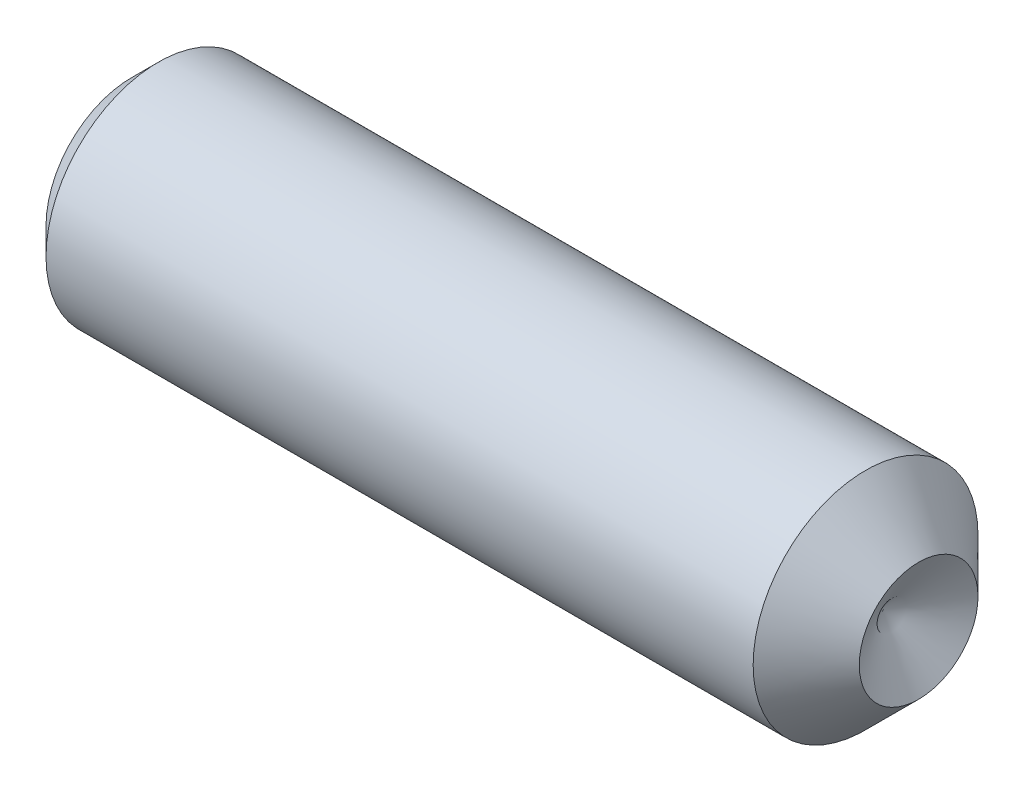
ISO-10303-21;
HEADER;
FILE_DESCRIPTION(('STEP AP214'),'2;1');
FILE_NAME('part.step','',(''),(''),'','','');
FILE_SCHEMA(('AUTOMOTIVE_DESIGN { 1 0 10303 214 1 1 1 1 }'));
ENDSEC;
DATA;
#1=APPLICATION_CONTEXT('core data for automotive mechanical design processes');
#2=APPLICATION_PROTOCOL_DEFINITION('international standard','automotive_design',2000,#1);
#3=PRODUCT_CONTEXT('',#1,'mechanical');
#4=PRODUCT('Part','Part','',(#3));
#5=PRODUCT_RELATED_PRODUCT_CATEGORY('part','',(#4));
#6=PRODUCT_DEFINITION_FORMATION('','',#4);
#7=PRODUCT_DEFINITION_CONTEXT('part definition',#1,'design');
#8=PRODUCT_DEFINITION('design','',#6,#7);
#9=PRODUCT_DEFINITION_SHAPE('','',#8);
#10=(LENGTH_UNIT() NAMED_UNIT(*) SI_UNIT(.MILLI.,.METRE.));
#11=(NAMED_UNIT(*) PLANE_ANGLE_UNIT() SI_UNIT($,.RADIAN.));
#12=(NAMED_UNIT(*) SI_UNIT($,.STERADIAN.) SOLID_ANGLE_UNIT());
#13=UNCERTAINTY_MEASURE_WITH_UNIT(LENGTH_MEASURE(1.E-05),#10,'distance_accuracy_value','');
#14=(GEOMETRIC_REPRESENTATION_CONTEXT(3) GLOBAL_UNCERTAINTY_ASSIGNED_CONTEXT((#13)) GLOBAL_UNIT_ASSIGNED_CONTEXT((#10,
#11,#12)) REPRESENTATION_CONTEXT('',''));
#15=CARTESIAN_POINT('',(0.,0.,0.));
#16=DIRECTION('',(0.,0.,1.));
#17=DIRECTION('',(1.,0.,0.));
#18=AXIS2_PLACEMENT_3D('',#15,#16,#17);
#19=CARTESIAN_POINT('',(0.,0.,0.));
#20=DIRECTION('',(-1.,0.,0.));
#21=DIRECTION('',(0.,0.,1.));
#22=AXIS2_PLACEMENT_3D('',#19,#20,#21);
#23=PLANE('',#22);
#24=CARTESIAN_POINT('',(0.,0.,0.));
#25=DIRECTION('',(-1.,0.,0.));
#26=DIRECTION('',(0.,0.,1.));
#27=AXIS2_PLACEMENT_3D('',#24,#25,#26);
#28=CIRCLE('',#27,2.41935);
#29=CARTESIAN_POINT('',(0.,0.,2.41935));
#30=VERTEX_POINT('',#29);
#31=EDGE_CURVE('E11',#30,#30,#28,.T.);
#32=ORIENTED_EDGE('',*,*,#31,.T.);
#33=EDGE_LOOP('',(#32));
#34=FACE_BOUND('',#33,.T.);
#35=DIRECTION('',(0.,0.,-1.));
#36=VECTOR('',#35,1.);
#37=CARTESIAN_POINT('',(0.,1.58750000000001,0.916543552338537));
#38=LINE('',#37,#36);
#39=CARTESIAN_POINT('',(0.,1.58750000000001,0.916543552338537));
#40=VERTEX_POINT('',#39);
#41=CARTESIAN_POINT('',(0.,1.58750000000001,-0.916543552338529));
#42=VERTEX_POINT('',#41);
#43=EDGE_CURVE('E106',#40,#42,#38,.T.);
#44=ORIENTED_EDGE('',*,*,#43,.F.);
#45=DIRECTION('',(0.,-0.86602540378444,0.499999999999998));
#46=VECTOR('',#45,1.);
#47=CARTESIAN_POINT('',(0.,1.58750000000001,0.916543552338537));
#48=LINE('',#47,#46);
#49=CARTESIAN_POINT('',(0.,0.,1.83308710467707));
#50=VERTEX_POINT('',#49);
#51=EDGE_CURVE('E56',#40,#50,#48,.T.);
#52=ORIENTED_EDGE('',*,*,#51,.T.);
#53=DIRECTION('',(0.,0.866025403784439,0.5));
#54=VECTOR('',#53,1.);
#55=CARTESIAN_POINT('',(0.,-1.5875,0.916543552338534));
#56=LINE('',#55,#54);
#57=CARTESIAN_POINT('',(0.,-1.5875,0.916543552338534));
#58=VERTEX_POINT('',#57);
#59=EDGE_CURVE('E115',#58,#50,#56,.T.);
#60=ORIENTED_EDGE('',*,*,#59,.F.);
#61=DIRECTION('',(0.,0.,-1.));
#62=VECTOR('',#61,1.);
#63=CARTESIAN_POINT('',(0.,-1.5875,0.916543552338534));
#64=LINE('',#63,#62);
#65=CARTESIAN_POINT('',(0.,-1.5875,-0.916543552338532));
#66=VERTEX_POINT('',#65);
#67=EDGE_CURVE('E135',#58,#66,#64,.T.);
#68=ORIENTED_EDGE('',*,*,#67,.T.);
#69=DIRECTION('',(0.,0.86602540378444,-0.499999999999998));
#70=VECTOR('',#69,1.);
#71=CARTESIAN_POINT('',(0.,-1.5875,-0.916543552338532));
#72=LINE('',#71,#70);
#73=CARTESIAN_POINT('',(0.,0.,-1.83308710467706));
#74=VERTEX_POINT('',#73);
#75=EDGE_CURVE('E131',#66,#74,#72,.T.);
#76=ORIENTED_EDGE('',*,*,#75,.T.);
#77=DIRECTION('',(0.,-0.866025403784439,-0.5));
#78=VECTOR('',#77,1.);
#79=CARTESIAN_POINT('',(0.,1.58750000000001,-0.916543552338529));
#80=LINE('',#79,#78);
#81=EDGE_CURVE('E136',#42,#74,#80,.T.);
#82=ORIENTED_EDGE('',*,*,#81,.F.);
#83=EDGE_LOOP('',(#44,#52,#60,#68,#76,#82));
#84=FACE_BOUND('',#83,.T.);
#85=ADVANCED_FACE('F44',(#34,#84),#23,.T.);
#86=CARTESIAN_POINT('',(0.,0.,0.));
#87=DIRECTION('',(1.,0.,0.));
#88=DIRECTION('',(0.,0.,-1.));
#89=AXIS2_PLACEMENT_3D('',#86,#87,#88);
#90=CONICAL_SURFACE('',#89,2.41935,0.785398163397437);
#91=CARTESIAN_POINT('',(0.755650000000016,0.,0.));
#92=DIRECTION('',(-1.,0.,0.));
#93=DIRECTION('',(0.,0.,1.));
#94=AXIS2_PLACEMENT_3D('',#91,#92,#93);
#95=CIRCLE('',#94,3.175);
#96=CARTESIAN_POINT('',(0.755650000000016,0.,3.175));
#97=VERTEX_POINT('',#96);
#98=EDGE_CURVE('E55',#97,#97,#95,.T.);
#99=ORIENTED_EDGE('',*,*,#98,.T.);
#100=EDGE_LOOP('',(#99));
#101=FACE_BOUND('',#100,.T.);
#102=ORIENTED_EDGE('',*,*,#31,.F.);
#103=EDGE_LOOP('',(#102));
#104=FACE_BOUND('',#103,.T.);
#105=ADVANCED_FACE('F156',(#101,#104),#90,.T.);
#106=CARTESIAN_POINT('',(-12.7,0.,0.));
#107=DIRECTION('',(-1.,0.,0.));
#108=DIRECTION('',(0.,0.,1.));
#109=AXIS2_PLACEMENT_3D('',#106,#107,#108);
#110=CYLINDRICAL_SURFACE('',#109,3.175);
#111=CARTESIAN_POINT('',(20.7264,0.,0.));
#112=DIRECTION('',(-1.,0.,0.));
#113=DIRECTION('',(0.,0.,1.));
#114=AXIS2_PLACEMENT_3D('',#111,#112,#113);
#115=CIRCLE('',#114,3.175);
#116=CARTESIAN_POINT('',(20.7264,0.,3.175));
#117=VERTEX_POINT('',#116);
#118=EDGE_CURVE('E153',#117,#117,#115,.T.);
#119=ORIENTED_EDGE('',*,*,#118,.T.);
#120=EDGE_LOOP('',(#119));
#121=FACE_BOUND('',#120,.T.);
#122=ORIENTED_EDGE('',*,*,#98,.F.);
#123=EDGE_LOOP('',(#122));
#124=FACE_BOUND('',#123,.T.);
#125=ADVANCED_FACE('F163',(#121,#124),#110,.T.);
#126=CARTESIAN_POINT('',(20.7264,0.,0.));
#127=DIRECTION('',(-1.,0.,0.));
#128=DIRECTION('',(0.,0.,1.));
#129=AXIS2_PLACEMENT_3D('',#126,#127,#128);
#130=CONICAL_SURFACE('',#129,3.175,0.785398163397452);
#131=CARTESIAN_POINT('',(22.225,0.,0.));
#132=DIRECTION('',(-1.,0.,0.));
#133=DIRECTION('',(0.,0.,1.));
#134=AXIS2_PLACEMENT_3D('',#131,#132,#133);
#135=CIRCLE('',#134,1.6764);
#136=CARTESIAN_POINT('',(22.225,0.,1.6764));
#137=VERTEX_POINT('',#136);
#138=EDGE_CURVE('E113',#137,#137,#135,.T.);
#139=ORIENTED_EDGE('',*,*,#138,.T.);
#140=EDGE_LOOP('',(#139));
#141=FACE_BOUND('',#140,.T.);
#142=ORIENTED_EDGE('',*,*,#118,.F.);
#143=EDGE_LOOP('',(#142));
#144=FACE_BOUND('',#143,.T.);
#145=ADVANCED_FACE('F161',(#141,#144),#130,.T.);
#146=CARTESIAN_POINT('',(21.2177172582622,0.,0.));
#147=DIRECTION('',(1.,0.,0.));
#148=DIRECTION('',(0.,0.,-1.));
#149=AXIS2_PLACEMENT_3D('',#146,#147,#148);
#150=CONICAL_SURFACE('',#149,0.,1.02974425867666);
#151=ORIENTED_EDGE('',*,*,#138,.F.);
#152=EDGE_LOOP('',(#151));
#153=FACE_BOUND('',#152,.T.);
#154=CARTESIAN_POINT('',(21.2177172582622,0.,0.));
#155=VERTEX_POINT('',#154);
#156=VERTEX_LOOP('',#155);
#157=FACE_BOUND('',#156,.T.);
#158=ADVANCED_FACE('F169',(#153,#157),#150,.F.);
#159=CARTESIAN_POINT('',(3.175,1.58750000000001,0.916543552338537));
#160=DIRECTION('',(0.,-0.499999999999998,-0.86602540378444));
#161=DIRECTION('',(0.,0.86602540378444,-0.499999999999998));
#162=AXIS2_PLACEMENT_3D('',#159,#160,#161);
#163=PLANE('',#162);
#164=ORIENTED_EDGE('',*,*,#51,.F.);
#165=DIRECTION('',(-1.,0.,0.));
#166=VECTOR('',#165,1.);
#167=CARTESIAN_POINT('',(3.175,1.58750000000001,0.916543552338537));
#168=LINE('',#167,#166);
#169=CARTESIAN_POINT('',(3.175,1.58750000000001,0.916543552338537));
#170=VERTEX_POINT('',#169);
#171=EDGE_CURVE('E99',#170,#40,#168,.T.);
#172=ORIENTED_EDGE('',*,*,#171,.F.);
#173=DIRECTION('',(0.,-0.86602540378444,0.499999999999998));
#174=VECTOR('',#173,1.);
#175=CARTESIAN_POINT('',(3.175,1.58750000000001,0.916543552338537));
#176=LINE('',#175,#174);
#177=CARTESIAN_POINT('',(3.175,0.,1.83308710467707));
#178=VERTEX_POINT('',#177);
#179=EDGE_CURVE('E92',#170,#178,#176,.T.);
#180=ORIENTED_EDGE('',*,*,#179,.T.);
#181=DIRECTION('',(-1.,0.,0.));
#182=VECTOR('',#181,1.);
#183=CARTESIAN_POINT('',(3.175,0.,1.83308710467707));
#184=LINE('',#183,#182);
#185=EDGE_CURVE('E96',#178,#50,#184,.T.);
#186=ORIENTED_EDGE('',*,*,#185,.T.);
#187=EDGE_LOOP('',(#164,#172,#180,#186));
#188=FACE_BOUND('',#187,.T.);
#189=ADVANCED_FACE('F97',(#188),#163,.T.);
#190=CARTESIAN_POINT('',(3.175,-1.5875,0.916543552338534));
#191=DIRECTION('',(0.,-0.5,0.866025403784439));
#192=DIRECTION('',(0.,-0.866025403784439,-0.5));
#193=AXIS2_PLACEMENT_3D('',#190,#191,#192);
#194=PLANE('',#193);
#195=ORIENTED_EDGE('',*,*,#59,.T.);
#196=ORIENTED_EDGE('',*,*,#185,.F.);
#197=DIRECTION('',(0.,0.866025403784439,0.5));
#198=VECTOR('',#197,1.);
#199=CARTESIAN_POINT('',(3.175,-1.5875,0.916543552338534));
#200=LINE('',#199,#198);
#201=CARTESIAN_POINT('',(3.175,-1.5875,0.916543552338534));
#202=VERTEX_POINT('',#201);
#203=EDGE_CURVE('E102',#202,#178,#200,.T.);
#204=ORIENTED_EDGE('',*,*,#203,.F.);
#205=DIRECTION('',(-1.,0.,0.));
#206=VECTOR('',#205,1.);
#207=CARTESIAN_POINT('',(3.175,-1.5875,0.916543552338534));
#208=LINE('',#207,#206);
#209=EDGE_CURVE('E112',#202,#58,#208,.T.);
#210=ORIENTED_EDGE('',*,*,#209,.T.);
#211=EDGE_LOOP('',(#195,#196,#204,#210));
#212=FACE_BOUND('',#211,.T.);
#213=ADVANCED_FACE('F109',(#212),#194,.F.);
#214=CARTESIAN_POINT('',(3.175,-1.5875,0.916543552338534));
#215=DIRECTION('',(0.,1.,0.));
#216=DIRECTION('',(0.,0.,1.));
#217=AXIS2_PLACEMENT_3D('',#214,#215,#216);
#218=PLANE('',#217);
#219=ORIENTED_EDGE('',*,*,#67,.F.);
#220=ORIENTED_EDGE('',*,*,#209,.F.);
#221=DIRECTION('',(0.,0.,-1.));
#222=VECTOR('',#221,1.);
#223=CARTESIAN_POINT('',(3.175,-1.5875,0.916543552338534));
#224=LINE('',#223,#222);
#225=CARTESIAN_POINT('',(3.175,-1.5875,-0.916543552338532));
#226=VERTEX_POINT('',#225);
#227=EDGE_CURVE('E118',#202,#226,#224,.T.);
#228=ORIENTED_EDGE('',*,*,#227,.T.);
#229=DIRECTION('',(-1.,0.,0.));
#230=VECTOR('',#229,1.);
#231=CARTESIAN_POINT('',(3.175,-1.5875,-0.916543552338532));
#232=LINE('',#231,#230);
#233=EDGE_CURVE('E150',#226,#66,#232,.T.);
#234=ORIENTED_EDGE('',*,*,#233,.T.);
#235=EDGE_LOOP('',(#219,#220,#228,#234));
#236=FACE_BOUND('',#235,.T.);
#237=ADVANCED_FACE('F192',(#236),#218,.T.);
#238=CARTESIAN_POINT('',(3.175,-1.5875,-0.916543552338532));
#239=DIRECTION('',(0.,0.499999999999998,0.86602540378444));
#240=DIRECTION('',(0.,-0.86602540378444,0.499999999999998));
#241=AXIS2_PLACEMENT_3D('',#238,#239,#240);
#242=PLANE('',#241);
#243=ORIENTED_EDGE('',*,*,#75,.F.);
#244=ORIENTED_EDGE('',*,*,#233,.F.);
#245=DIRECTION('',(0.,0.86602540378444,-0.499999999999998));
#246=VECTOR('',#245,1.);
#247=CARTESIAN_POINT('',(3.175,-1.5875,-0.916543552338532));
#248=LINE('',#247,#246);
#249=CARTESIAN_POINT('',(3.175,0.,-1.83308710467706));
#250=VERTEX_POINT('',#249);
#251=EDGE_CURVE('E122',#226,#250,#248,.T.);
#252=ORIENTED_EDGE('',*,*,#251,.T.);
#253=DIRECTION('',(-1.,0.,0.));
#254=VECTOR('',#253,1.);
#255=CARTESIAN_POINT('',(3.175,0.,-1.83308710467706));
#256=LINE('',#255,#254);
#257=EDGE_CURVE('E149',#250,#74,#256,.T.);
#258=ORIENTED_EDGE('',*,*,#257,.T.);
#259=EDGE_LOOP('',(#243,#244,#252,#258));
#260=FACE_BOUND('',#259,.T.);
#261=ADVANCED_FACE('F194',(#260),#242,.T.);
#262=CARTESIAN_POINT('',(3.175,1.58750000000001,-0.916543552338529));
#263=DIRECTION('',(0.,0.5,-0.866025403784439));
#264=DIRECTION('',(0.,0.866025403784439,0.5));
#265=AXIS2_PLACEMENT_3D('',#262,#263,#264);
#266=PLANE('',#265);
#267=ORIENTED_EDGE('',*,*,#81,.T.);
#268=ORIENTED_EDGE('',*,*,#257,.F.);
#269=DIRECTION('',(0.,-0.866025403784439,-0.5));
#270=VECTOR('',#269,1.);
#271=CARTESIAN_POINT('',(3.175,1.58750000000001,-0.916543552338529));
#272=LINE('',#271,#270);
#273=CARTESIAN_POINT('',(3.175,1.58750000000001,-0.916543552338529));
#274=VERTEX_POINT('',#273);
#275=EDGE_CURVE('E123',#274,#250,#272,.T.);
#276=ORIENTED_EDGE('',*,*,#275,.F.);
#277=DIRECTION('',(-1.,0.,0.));
#278=VECTOR('',#277,1.);
#279=CARTESIAN_POINT('',(3.175,1.58750000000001,-0.916543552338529));
#280=LINE('',#279,#278);
#281=EDGE_CURVE('E144',#274,#42,#280,.T.);
#282=ORIENTED_EDGE('',*,*,#281,.T.);
#283=EDGE_LOOP('',(#267,#268,#276,#282));
#284=FACE_BOUND('',#283,.T.);
#285=ADVANCED_FACE('F189',(#284),#266,.F.);
#286=CARTESIAN_POINT('',(3.175,1.58750000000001,0.916543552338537));
#287=DIRECTION('',(0.,1.,0.));
#288=DIRECTION('',(0.,0.,1.));
#289=AXIS2_PLACEMENT_3D('',#286,#287,#288);
#290=PLANE('',#289);
#291=ORIENTED_EDGE('',*,*,#43,.T.);
#292=ORIENTED_EDGE('',*,*,#281,.F.);
#293=DIRECTION('',(0.,0.,-1.));
#294=VECTOR('',#293,1.);
#295=CARTESIAN_POINT('',(3.175,1.58750000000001,0.916543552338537));
#296=LINE('',#295,#294);
#297=EDGE_CURVE('E130',#170,#274,#296,.T.);
#298=ORIENTED_EDGE('',*,*,#297,.F.);
#299=ORIENTED_EDGE('',*,*,#171,.T.);
#300=EDGE_LOOP('',(#291,#292,#298,#299));
#301=FACE_BOUND('',#300,.T.);
#302=ADVANCED_FACE('F183',(#301),#290,.F.);
#303=CARTESIAN_POINT('',(3.175,1.58750000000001,0.916543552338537));
#304=DIRECTION('',(1.,0.,0.));
#305=DIRECTION('',(0.,0.,-1.));
#306=AXIS2_PLACEMENT_3D('',#303,#304,#305);
#307=PLANE('',#306);
#308=ORIENTED_EDGE('',*,*,#179,.F.);
#309=ORIENTED_EDGE('',*,*,#297,.T.);
#310=ORIENTED_EDGE('',*,*,#275,.T.);
#311=ORIENTED_EDGE('',*,*,#251,.F.);
#312=ORIENTED_EDGE('',*,*,#227,.F.);
#313=ORIENTED_EDGE('',*,*,#203,.T.);
#314=EDGE_LOOP('',(#308,#309,#310,#311,#312,#313));
#315=FACE_BOUND('',#314,.T.);
#316=ADVANCED_FACE('F120',(#315),#307,.F.);
#317=CLOSED_SHELL('',(#85,#105,#125,#145,#158,#189,#213,#237,#261,#285,#302,#316));
#318=MANIFOLD_SOLID_BREP('B2',#317);
#319=ADVANCED_BREP_SHAPE_REPRESENTATION('',(#18,#318),#14);
#320=SHAPE_DEFINITION_REPRESENTATION(#9,#319);
ENDSEC;
END-ISO-10303-21;
